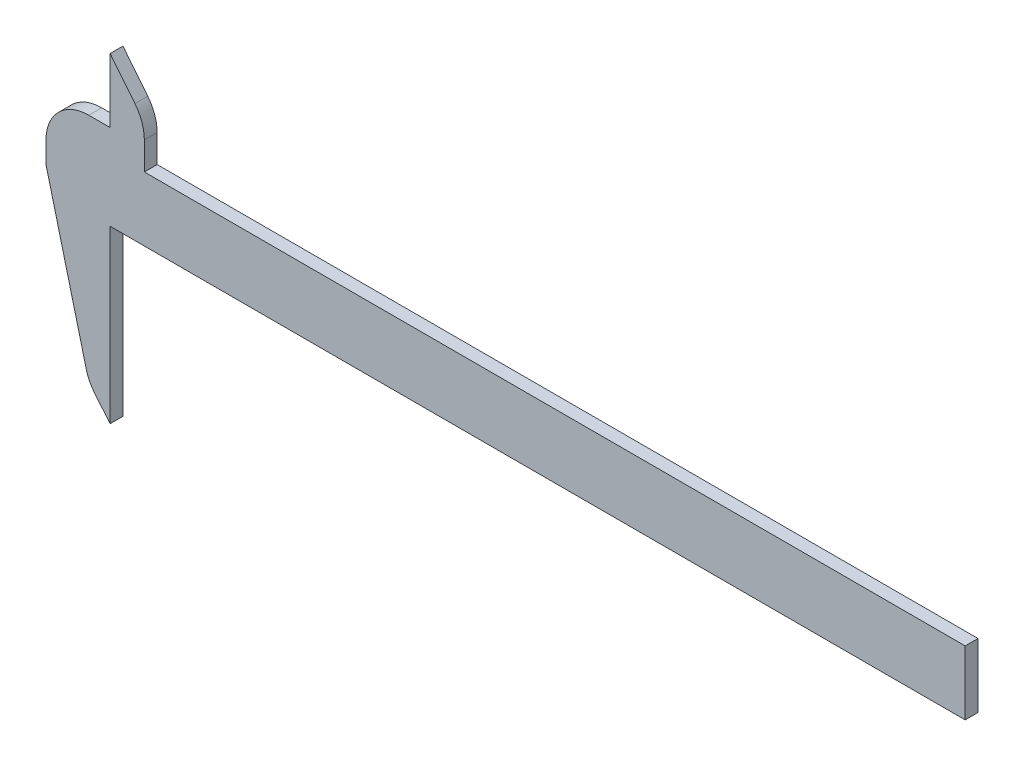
ISO-10303-21;
HEADER;
FILE_DESCRIPTION(('STEP AP214'),'2;1');
FILE_NAME('part.step','',(''),(''),'','','');
FILE_SCHEMA(('AUTOMOTIVE_DESIGN { 1 0 10303 214 1 1 1 1 }'));
ENDSEC;
DATA;
#1=APPLICATION_CONTEXT('core data for automotive mechanical design processes');
#2=APPLICATION_PROTOCOL_DEFINITION('international standard','automotive_design',2000,#1);
#3=PRODUCT_CONTEXT('',#1,'mechanical');
#4=PRODUCT('Part','Part','',(#3));
#5=PRODUCT_RELATED_PRODUCT_CATEGORY('part','',(#4));
#6=PRODUCT_DEFINITION_FORMATION('','',#4);
#7=PRODUCT_DEFINITION_CONTEXT('part definition',#1,'design');
#8=PRODUCT_DEFINITION('design','',#6,#7);
#9=PRODUCT_DEFINITION_SHAPE('','',#8);
#10=(LENGTH_UNIT() NAMED_UNIT(*) SI_UNIT(.MILLI.,.METRE.));
#11=(NAMED_UNIT(*) PLANE_ANGLE_UNIT() SI_UNIT($,.RADIAN.));
#12=(NAMED_UNIT(*) SI_UNIT($,.STERADIAN.) SOLID_ANGLE_UNIT());
#13=UNCERTAINTY_MEASURE_WITH_UNIT(LENGTH_MEASURE(1.E-05),#10,'distance_accuracy_value','');
#14=(GEOMETRIC_REPRESENTATION_CONTEXT(3) GLOBAL_UNCERTAINTY_ASSIGNED_CONTEXT((#13)) GLOBAL_UNIT_ASSIGNED_CONTEXT((#10,
#11,#12)) REPRESENTATION_CONTEXT('',''));
#15=CARTESIAN_POINT('',(0.,0.,0.));
#16=DIRECTION('',(0.,0.,1.));
#17=DIRECTION('',(1.,0.,0.));
#18=AXIS2_PLACEMENT_3D('',#15,#16,#17);
#19=CARTESIAN_POINT('',(0.,-40.,3.));
#20=DIRECTION('',(-1.,0.,0.));
#21=DIRECTION('',(0.,0.,1.));
#22=AXIS2_PLACEMENT_3D('',#19,#20,#21);
#23=PLANE('',#22);
#24=DIRECTION('',(0.,1.,0.));
#25=VECTOR('',#24,1.);
#26=CARTESIAN_POINT('',(0.,-40.,0.));
#27=LINE('',#26,#25);
#28=CARTESIAN_POINT('',(0.,-40.,0.));
#29=VERTEX_POINT('',#28);
#30=CARTESIAN_POINT('',(0.,0.,0.));
#31=VERTEX_POINT('',#30);
#32=EDGE_CURVE('E156',#29,#31,#27,.T.);
#33=ORIENTED_EDGE('',*,*,#32,.T.);
#34=DIRECTION('',(0.,0.,-1.));
#35=VECTOR('',#34,1.);
#36=CARTESIAN_POINT('',(0.,0.,3.));
#37=LINE('',#36,#35);
#38=CARTESIAN_POINT('',(0.,0.,3.));
#39=VERTEX_POINT('',#38);
#40=EDGE_CURVE('E137',#39,#31,#37,.T.);
#41=ORIENTED_EDGE('',*,*,#40,.F.);
#42=DIRECTION('',(0.,1.,0.));
#43=VECTOR('',#42,1.);
#44=CARTESIAN_POINT('',(0.,-40.,3.));
#45=LINE('',#44,#43);
#46=CARTESIAN_POINT('',(0.,-40.,3.));
#47=VERTEX_POINT('',#46);
#48=EDGE_CURVE('E144',#47,#39,#45,.T.);
#49=ORIENTED_EDGE('',*,*,#48,.F.);
#50=DIRECTION('',(0.,0.,-1.));
#51=VECTOR('',#50,1.);
#52=CARTESIAN_POINT('',(0.,-40.,3.));
#53=LINE('',#52,#51);
#54=EDGE_CURVE('E213',#47,#29,#53,.T.);
#55=ORIENTED_EDGE('',*,*,#54,.T.);
#56=EDGE_LOOP('',(#33,#41,#49,#55));
#57=FACE_BOUND('',#56,.T.);
#58=ADVANCED_FACE('F32',(#57),#23,.F.);
#59=CARTESIAN_POINT('',(0.,0.,3.));
#60=DIRECTION('',(0.,1.,0.));
#61=DIRECTION('',(0.,0.,1.));
#62=AXIS2_PLACEMENT_3D('',#59,#60,#61);
#63=PLANE('',#62);
#64=DIRECTION('',(1.,0.,0.));
#65=VECTOR('',#64,1.);
#66=CARTESIAN_POINT('',(0.,0.,0.));
#67=LINE('',#66,#65);
#68=CARTESIAN_POINT('',(200.,0.,0.));
#69=VERTEX_POINT('',#68);
#70=EDGE_CURVE('E236',#31,#69,#67,.T.);
#71=ORIENTED_EDGE('',*,*,#70,.T.);
#72=DIRECTION('',(0.,0.,-1.));
#73=VECTOR('',#72,1.);
#74=CARTESIAN_POINT('',(200.,0.,3.));
#75=LINE('',#74,#73);
#76=CARTESIAN_POINT('',(200.,0.,3.));
#77=VERTEX_POINT('',#76);
#78=EDGE_CURVE('E140',#77,#69,#75,.T.);
#79=ORIENTED_EDGE('',*,*,#78,.F.);
#80=DIRECTION('',(1.,0.,0.));
#81=VECTOR('',#80,1.);
#82=CARTESIAN_POINT('',(0.,0.,3.));
#83=LINE('',#82,#81);
#84=EDGE_CURVE('E133',#39,#77,#83,.T.);
#85=ORIENTED_EDGE('',*,*,#84,.F.);
#86=ORIENTED_EDGE('',*,*,#40,.T.);
#87=EDGE_LOOP('',(#71,#79,#85,#86));
#88=FACE_BOUND('',#87,.T.);
#89=ADVANCED_FACE('F135',(#88),#63,.F.);
#90=CARTESIAN_POINT('',(200.,0.,3.));
#91=DIRECTION('',(-1.,0.,0.));
#92=DIRECTION('',(0.,0.,1.));
#93=AXIS2_PLACEMENT_3D('',#90,#91,#92);
#94=PLANE('',#93);
#95=DIRECTION('',(0.,1.,0.));
#96=VECTOR('',#95,1.);
#97=CARTESIAN_POINT('',(200.,0.,0.));
#98=LINE('',#97,#96);
#99=CARTESIAN_POINT('',(200.,15.,0.));
#100=VERTEX_POINT('',#99);
#101=EDGE_CURVE('E235',#69,#100,#98,.T.);
#102=ORIENTED_EDGE('',*,*,#101,.T.);
#103=DIRECTION('',(0.,0.,-1.));
#104=VECTOR('',#103,1.);
#105=CARTESIAN_POINT('',(200.,15.,3.));
#106=LINE('',#105,#104);
#107=CARTESIAN_POINT('',(200.,15.,3.));
#108=VERTEX_POINT('',#107);
#109=EDGE_CURVE('E162',#108,#100,#106,.T.);
#110=ORIENTED_EDGE('',*,*,#109,.F.);
#111=DIRECTION('',(0.,1.,0.));
#112=VECTOR('',#111,1.);
#113=CARTESIAN_POINT('',(200.,0.,3.));
#114=LINE('',#113,#112);
#115=EDGE_CURVE('E143',#77,#108,#114,.T.);
#116=ORIENTED_EDGE('',*,*,#115,.F.);
#117=ORIENTED_EDGE('',*,*,#78,.T.);
#118=EDGE_LOOP('',(#102,#110,#116,#117));
#119=FACE_BOUND('',#118,.T.);
#120=ADVANCED_FACE('F256',(#119),#94,.F.);
#121=CARTESIAN_POINT('',(200.,15.,3.));
#122=DIRECTION('',(0.,-1.,0.));
#123=DIRECTION('',(1.,0.,0.));
#124=AXIS2_PLACEMENT_3D('',#121,#122,#123);
#125=PLANE('',#124);
#126=DIRECTION('',(-1.,0.,0.));
#127=VECTOR('',#126,1.);
#128=CARTESIAN_POINT('',(200.,15.,0.));
#129=LINE('',#128,#127);
#130=CARTESIAN_POINT('',(8.00000000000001,15.,0.));
#131=VERTEX_POINT('',#130);
#132=EDGE_CURVE('E201',#100,#131,#129,.T.);
#133=ORIENTED_EDGE('',*,*,#132,.T.);
#134=DIRECTION('',(0.,0.,-1.));
#135=VECTOR('',#134,1.);
#136=CARTESIAN_POINT('',(8.00000000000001,15.,3.));
#137=LINE('',#136,#135);
#138=CARTESIAN_POINT('',(8.00000000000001,15.,3.));
#139=VERTEX_POINT('',#138);
#140=EDGE_CURVE('E223',#139,#131,#137,.T.);
#141=ORIENTED_EDGE('',*,*,#140,.F.);
#142=DIRECTION('',(-1.,0.,0.));
#143=VECTOR('',#142,1.);
#144=CARTESIAN_POINT('',(200.,15.,3.));
#145=LINE('',#144,#143);
#146=EDGE_CURVE('E232',#108,#139,#145,.T.);
#147=ORIENTED_EDGE('',*,*,#146,.F.);
#148=ORIENTED_EDGE('',*,*,#109,.T.);
#149=EDGE_LOOP('',(#133,#141,#147,#148));
#150=FACE_BOUND('',#149,.T.);
#151=ADVANCED_FACE('F230',(#150),#125,.F.);
#152=CARTESIAN_POINT('',(8.00000000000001,15.,3.));
#153=DIRECTION('',(-1.,0.,0.));
#154=DIRECTION('',(0.,-1.,0.));
#155=AXIS2_PLACEMENT_3D('',#152,#153,#154);
#156=PLANE('',#155);
#157=DIRECTION('',(0.,1.,0.));
#158=VECTOR('',#157,1.);
#159=CARTESIAN_POINT('',(8.00000000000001,15.,0.));
#160=LINE('',#159,#158);
#161=CARTESIAN_POINT('',(8.,21.4921894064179,0.));
#162=VERTEX_POINT('',#161);
#163=EDGE_CURVE('E197',#131,#162,#160,.T.);
#164=ORIENTED_EDGE('',*,*,#163,.T.);
#165=DIRECTION('',(0.,0.,-1.));
#166=VECTOR('',#165,1.);
#167=CARTESIAN_POINT('',(8.,21.4921894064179,3.));
#168=LINE('',#167,#166);
#169=CARTESIAN_POINT('',(8.,21.4921894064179,3.));
#170=VERTEX_POINT('',#169);
#171=EDGE_CURVE('E40',#162,#170,#168,.F.);
#172=ORIENTED_EDGE('',*,*,#171,.T.);
#173=DIRECTION('',(0.,1.,0.));
#174=VECTOR('',#173,1.);
#175=CARTESIAN_POINT('',(8.00000000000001,15.,3.));
#176=LINE('',#175,#174);
#177=EDGE_CURVE('E253',#139,#170,#176,.T.);
#178=ORIENTED_EDGE('',*,*,#177,.F.);
#179=ORIENTED_EDGE('',*,*,#140,.T.);
#180=EDGE_LOOP('',(#164,#172,#178,#179));
#181=FACE_BOUND('',#180,.T.);
#182=ADVANCED_FACE('F263',(#181),#156,.F.);
#183=CARTESIAN_POINT('',(8.,25.,3.));
#184=DIRECTION('',(-0.78086880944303,-0.624695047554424,0.));
#185=DIRECTION('',(0.624695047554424,-0.78086880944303,0.));
#186=AXIS2_PLACEMENT_3D('',#183,#184,#185);
#187=PLANE('',#186);
#188=DIRECTION('',(-0.624695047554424,0.78086880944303,0.));
#189=VECTOR('',#188,1.);
#190=CARTESIAN_POINT('',(8.,25.,3.));
#191=LINE('',#190,#189);
#192=CARTESIAN_POINT('',(5.80868809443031,27.7391398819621,3.));
#193=VERTEX_POINT('',#192);
#194=CARTESIAN_POINT('',(0.,35.,3.));
#195=VERTEX_POINT('',#194);
#196=EDGE_CURVE('E190',#193,#195,#191,.T.);
#197=ORIENTED_EDGE('',*,*,#196,.F.);
#198=DIRECTION('',(0.,0.,-1.));
#199=VECTOR('',#198,1.);
#200=CARTESIAN_POINT('',(5.80868809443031,27.7391398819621,3.));
#201=LINE('',#200,#199);
#202=CARTESIAN_POINT('',(5.80868809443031,27.7391398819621,0.));
#203=VERTEX_POINT('',#202);
#204=EDGE_CURVE('E180',#193,#203,#201,.T.);
#205=ORIENTED_EDGE('',*,*,#204,.T.);
#206=DIRECTION('',(-0.624695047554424,0.78086880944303,0.));
#207=VECTOR('',#206,1.);
#208=CARTESIAN_POINT('',(8.,25.,0.));
#209=LINE('',#208,#207);
#210=CARTESIAN_POINT('',(0.,35.,0.));
#211=VERTEX_POINT('',#210);
#212=EDGE_CURVE('E188',#203,#211,#209,.T.);
#213=ORIENTED_EDGE('',*,*,#212,.T.);
#214=DIRECTION('',(0.,0.,-1.));
#215=VECTOR('',#214,1.);
#216=CARTESIAN_POINT('',(0.,35.,3.));
#217=LINE('',#216,#215);
#218=EDGE_CURVE('E221',#195,#211,#217,.T.);
#219=ORIENTED_EDGE('',*,*,#218,.F.);
#220=EDGE_LOOP('',(#197,#205,#213,#219));
#221=FACE_BOUND('',#220,.T.);
#222=ADVANCED_FACE('F186',(#221),#187,.F.);
#223=CARTESIAN_POINT('',(0.,35.,3.));
#224=DIRECTION('',(1.,0.,0.));
#225=DIRECTION('',(0.,1.,0.));
#226=AXIS2_PLACEMENT_3D('',#223,#224,#225);
#227=PLANE('',#226);
#228=DIRECTION('',(0.,-1.,0.));
#229=VECTOR('',#228,1.);
#230=CARTESIAN_POINT('',(0.,35.,0.));
#231=LINE('',#230,#229);
#232=CARTESIAN_POINT('',(0.,20.,0.));
#233=VERTEX_POINT('',#232);
#234=EDGE_CURVE('E196',#211,#233,#231,.T.);
#235=ORIENTED_EDGE('',*,*,#234,.T.);
#236=DIRECTION('',(0.,0.,-1.));
#237=VECTOR('',#236,1.);
#238=CARTESIAN_POINT('',(0.,20.,3.));
#239=LINE('',#238,#237);
#240=CARTESIAN_POINT('',(0.,20.,3.));
#241=VERTEX_POINT('',#240);
#242=EDGE_CURVE('E218',#241,#233,#239,.T.);
#243=ORIENTED_EDGE('',*,*,#242,.F.);
#244=DIRECTION('',(0.,-1.,0.));
#245=VECTOR('',#244,1.);
#246=CARTESIAN_POINT('',(0.,35.,3.));
#247=LINE('',#246,#245);
#248=EDGE_CURVE('E250',#195,#241,#247,.T.);
#249=ORIENTED_EDGE('',*,*,#248,.F.);
#250=ORIENTED_EDGE('',*,*,#218,.T.);
#251=EDGE_LOOP('',(#235,#243,#249,#250));
#252=FACE_BOUND('',#251,.T.);
#253=ADVANCED_FACE('F304',(#252),#227,.F.);
#254=CARTESIAN_POINT('',(0.,20.,3.));
#255=DIRECTION('',(0.,-1.,0.));
#256=DIRECTION('',(1.,0.,0.));
#257=AXIS2_PLACEMENT_3D('',#254,#255,#256);
#258=PLANE('',#257);
#259=DIRECTION('',(-1.,0.,0.));
#260=VECTOR('',#259,1.);
#261=CARTESIAN_POINT('',(0.,20.,0.));
#262=LINE('',#261,#260);
#263=CARTESIAN_POINT('',(-5.,20.,0.));
#264=VERTEX_POINT('',#263);
#265=EDGE_CURVE('E199',#233,#264,#262,.T.);
#266=ORIENTED_EDGE('',*,*,#265,.T.);
#267=DIRECTION('',(0.,0.,-1.));
#268=VECTOR('',#267,1.);
#269=CARTESIAN_POINT('',(-5.,20.,3.));
#270=LINE('',#269,#268);
#271=CARTESIAN_POINT('',(-5.,20.,3.));
#272=VERTEX_POINT('',#271);
#273=EDGE_CURVE('E167',#264,#272,#270,.F.);
#274=ORIENTED_EDGE('',*,*,#273,.T.);
#275=DIRECTION('',(-1.,0.,0.));
#276=VECTOR('',#275,1.);
#277=CARTESIAN_POINT('',(0.,20.,3.));
#278=LINE('',#277,#276);
#279=EDGE_CURVE('E247',#241,#272,#278,.T.);
#280=ORIENTED_EDGE('',*,*,#279,.F.);
#281=ORIENTED_EDGE('',*,*,#242,.T.);
#282=EDGE_LOOP('',(#266,#274,#280,#281));
#283=FACE_BOUND('',#282,.T.);
#284=ADVANCED_FACE('F298',(#283),#258,.F.);
#285=CARTESIAN_POINT('',(-15.,20.,3.));
#286=DIRECTION('',(1.,0.,0.));
#287=DIRECTION('',(0.,0.,-1.));
#288=AXIS2_PLACEMENT_3D('',#285,#286,#287);
#289=PLANE('',#288);
#290=DIRECTION('',(0.,-1.,0.));
#291=VECTOR('',#290,1.);
#292=CARTESIAN_POINT('',(-15.,20.,3.));
#293=LINE('',#292,#291);
#294=CARTESIAN_POINT('',(-15.,9.99999999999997,3.));
#295=VERTEX_POINT('',#294);
#296=CARTESIAN_POINT('',(-15.,4.99999999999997,3.));
#297=VERTEX_POINT('',#296);
#298=EDGE_CURVE('E245',#295,#297,#293,.T.);
#299=ORIENTED_EDGE('',*,*,#298,.F.);
#300=DIRECTION('',(0.,0.,-1.));
#301=VECTOR('',#300,1.);
#302=CARTESIAN_POINT('',(-15.,9.99999999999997,3.));
#303=LINE('',#302,#301);
#304=CARTESIAN_POINT('',(-15.,9.99999999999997,0.));
#305=VERTEX_POINT('',#304);
#306=EDGE_CURVE('E157',#295,#305,#303,.T.);
#307=ORIENTED_EDGE('',*,*,#306,.T.);
#308=DIRECTION('',(0.,-1.,0.));
#309=VECTOR('',#308,1.);
#310=CARTESIAN_POINT('',(-15.,20.,0.));
#311=LINE('',#310,#309);
#312=CARTESIAN_POINT('',(-15.,4.99999999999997,0.));
#313=VERTEX_POINT('',#312);
#314=EDGE_CURVE('E207',#305,#313,#311,.T.);
#315=ORIENTED_EDGE('',*,*,#314,.T.);
#316=DIRECTION('',(0.,0.,-1.));
#317=VECTOR('',#316,1.);
#318=CARTESIAN_POINT('',(-15.,4.99999999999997,3.));
#319=LINE('',#318,#317);
#320=EDGE_CURVE('E215',#297,#313,#319,.T.);
#321=ORIENTED_EDGE('',*,*,#320,.F.);
#322=EDGE_LOOP('',(#299,#307,#315,#321));
#323=FACE_BOUND('',#322,.T.);
#324=ADVANCED_FACE('F294',(#323),#289,.F.);
#325=CARTESIAN_POINT('',(-15.,4.99999999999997,3.));
#326=DIRECTION('',(0.968663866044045,0.248375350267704,0.));
#327=DIRECTION('',(-0.248375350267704,0.968663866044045,0.));
#328=AXIS2_PLACEMENT_3D('',#325,#326,#327);
#329=PLANE('',#328);
#330=DIRECTION('',(0.248375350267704,-0.968663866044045,0.));
#331=VECTOR('',#330,1.);
#332=CARTESIAN_POINT('',(-15.,4.99999999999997,0.));
#333=LINE('',#332,#331);
#334=CARTESIAN_POINT('',(-5.56028868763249,-31.8148741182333,0.));
#335=VERTEX_POINT('',#334);
#336=EDGE_CURVE('E209',#313,#335,#333,.T.);
#337=ORIENTED_EDGE('',*,*,#336,.T.);
#338=DIRECTION('',(0.,0.,-1.));
#339=VECTOR('',#338,1.);
#340=CARTESIAN_POINT('',(-5.56028868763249,-31.8148741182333,3.));
#341=LINE('',#340,#339);
#342=CARTESIAN_POINT('',(-5.56028868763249,-31.8148741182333,3.));
#343=VERTEX_POINT('',#342);
#344=EDGE_CURVE('E176',#335,#343,#341,.F.);
#345=ORIENTED_EDGE('',*,*,#344,.T.);
#346=DIRECTION('',(0.248375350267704,-0.968663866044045,0.));
#347=VECTOR('',#346,1.);
#348=CARTESIAN_POINT('',(-15.,4.99999999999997,3.));
#349=LINE('',#348,#347);
#350=EDGE_CURVE('E242',#297,#343,#349,.T.);
#351=ORIENTED_EDGE('',*,*,#350,.F.);
#352=ORIENTED_EDGE('',*,*,#320,.T.);
#353=EDGE_LOOP('',(#337,#345,#351,#352));
#354=FACE_BOUND('',#353,.T.);
#355=ADVANCED_FACE('F290',(#354),#329,.F.);
#356=CARTESIAN_POINT('',(-5.,-34.,3.));
#357=DIRECTION('',(0.768221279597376,0.64018439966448,0.));
#358=DIRECTION('',(-0.64018439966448,0.768221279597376,0.));
#359=AXIS2_PLACEMENT_3D('',#356,#357,#358);
#360=PLANE('',#359);
#361=DIRECTION('',(0.64018439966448,-0.768221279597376,0.));
#362=VECTOR('',#361,1.);
#363=CARTESIAN_POINT('',(-5.,-34.,3.));
#364=LINE('',#363,#362);
#365=CARTESIAN_POINT('',(-3.5558628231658,-35.732964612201,3.));
#366=VERTEX_POINT('',#365);
#367=EDGE_CURVE('E149',#366,#47,#364,.T.);
#368=ORIENTED_EDGE('',*,*,#367,.F.);
#369=DIRECTION('',(0.,0.,-1.));
#370=VECTOR('',#369,1.);
#371=CARTESIAN_POINT('',(-3.5558628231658,-35.732964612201,3.));
#372=LINE('',#371,#370);
#373=CARTESIAN_POINT('',(-3.5558628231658,-35.732964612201,0.));
#374=VERTEX_POINT('',#373);
#375=EDGE_CURVE('E171',#366,#374,#372,.T.);
#376=ORIENTED_EDGE('',*,*,#375,.T.);
#377=DIRECTION('',(0.64018439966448,-0.768221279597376,0.));
#378=VECTOR('',#377,1.);
#379=CARTESIAN_POINT('',(-5.,-34.,0.));
#380=LINE('',#379,#378);
#381=EDGE_CURVE('E153',#374,#29,#380,.T.);
#382=ORIENTED_EDGE('',*,*,#381,.T.);
#383=ORIENTED_EDGE('',*,*,#54,.F.);
#384=EDGE_LOOP('',(#368,#376,#382,#383));
#385=FACE_BOUND('',#384,.T.);
#386=ADVANCED_FACE('F285',(#385),#360,.F.);
#387=CARTESIAN_POINT('',(0.,0.,3.));
#388=DIRECTION('',(0.,0.,-1.));
#389=DIRECTION('',(-1.,0.,0.));
#390=AXIS2_PLACEMENT_3D('',#387,#388,#389);
#391=PLANE('',#390);
#392=ORIENTED_EDGE('',*,*,#177,.T.);
#393=CARTESIAN_POINT('',(-2.,21.4921894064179,3.));
#394=DIRECTION('',(0.,0.,-1.));
#395=DIRECTION('',(-1.,0.,0.));
#396=AXIS2_PLACEMENT_3D('',#393,#394,#395);
#397=CIRCLE('',#396,10.);
#398=EDGE_CURVE('E11',#170,#193,#397,.F.);
#399=ORIENTED_EDGE('',*,*,#398,.T.);
#400=ORIENTED_EDGE('',*,*,#196,.T.);
#401=ORIENTED_EDGE('',*,*,#248,.T.);
#402=ORIENTED_EDGE('',*,*,#279,.T.);
#403=CARTESIAN_POINT('',(-5.,9.99999999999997,3.));
#404=DIRECTION('',(0.,0.,-1.));
#405=DIRECTION('',(-1.,0.,0.));
#406=AXIS2_PLACEMENT_3D('',#403,#404,#405);
#407=CIRCLE('',#406,10.);
#408=EDGE_CURVE('E169',#272,#295,#407,.F.);
#409=ORIENTED_EDGE('',*,*,#408,.T.);
#410=ORIENTED_EDGE('',*,*,#298,.T.);
#411=ORIENTED_EDGE('',*,*,#350,.T.);
#412=CARTESIAN_POINT('',(4.12634997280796,-29.3311206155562,3.));
#413=DIRECTION('',(0.,0.,-1.));
#414=DIRECTION('',(-1.,0.,0.));
#415=AXIS2_PLACEMENT_3D('',#412,#413,#414);
#416=CIRCLE('',#415,10.);
#417=EDGE_CURVE('E178',#343,#366,#416,.F.);
#418=ORIENTED_EDGE('',*,*,#417,.T.);
#419=ORIENTED_EDGE('',*,*,#367,.T.);
#420=ORIENTED_EDGE('',*,*,#48,.T.);
#421=ORIENTED_EDGE('',*,*,#84,.T.);
#422=ORIENTED_EDGE('',*,*,#115,.T.);
#423=ORIENTED_EDGE('',*,*,#146,.T.);
#424=EDGE_LOOP('',(#392,#399,#400,#401,#402,#409,#410,#411,#418,#419,#420,#421,#422,#423));
#425=FACE_BOUND('',#424,.T.);
#426=ADVANCED_FACE('F147',(#425),#391,.F.);
#427=CARTESIAN_POINT('',(0.,0.,0.));
#428=DIRECTION('',(0.,0.,-1.));
#429=DIRECTION('',(-1.,0.,0.));
#430=AXIS2_PLACEMENT_3D('',#427,#428,#429);
#431=PLANE('',#430);
#432=ORIENTED_EDGE('',*,*,#212,.F.);
#433=CARTESIAN_POINT('',(-2.,21.4921894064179,0.));
#434=DIRECTION('',(0.,0.,-1.));
#435=DIRECTION('',(-1.,0.,0.));
#436=AXIS2_PLACEMENT_3D('',#433,#434,#435);
#437=CIRCLE('',#436,10.);
#438=EDGE_CURVE('E54',#203,#162,#437,.T.);
#439=ORIENTED_EDGE('',*,*,#438,.T.);
#440=ORIENTED_EDGE('',*,*,#163,.F.);
#441=ORIENTED_EDGE('',*,*,#132,.F.);
#442=ORIENTED_EDGE('',*,*,#101,.F.);
#443=ORIENTED_EDGE('',*,*,#70,.F.);
#444=ORIENTED_EDGE('',*,*,#32,.F.);
#445=ORIENTED_EDGE('',*,*,#381,.F.);
#446=CARTESIAN_POINT('',(4.12634997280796,-29.3311206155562,0.));
#447=DIRECTION('',(0.,0.,-1.));
#448=DIRECTION('',(-1.,0.,0.));
#449=AXIS2_PLACEMENT_3D('',#446,#447,#448);
#450=CIRCLE('',#449,10.);
#451=EDGE_CURVE('E174',#374,#335,#450,.T.);
#452=ORIENTED_EDGE('',*,*,#451,.T.);
#453=ORIENTED_EDGE('',*,*,#336,.F.);
#454=ORIENTED_EDGE('',*,*,#314,.F.);
#455=CARTESIAN_POINT('',(-5.,9.99999999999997,0.));
#456=DIRECTION('',(0.,0.,-1.));
#457=DIRECTION('',(-1.,0.,0.));
#458=AXIS2_PLACEMENT_3D('',#455,#456,#457);
#459=CIRCLE('',#458,10.);
#460=EDGE_CURVE('E160',#305,#264,#459,.T.);
#461=ORIENTED_EDGE('',*,*,#460,.T.);
#462=ORIENTED_EDGE('',*,*,#265,.F.);
#463=ORIENTED_EDGE('',*,*,#234,.F.);
#464=EDGE_LOOP('',(#432,#439,#440,#441,#442,#443,#444,#445,#452,#453,#454,#461,#462,#463));
#465=FACE_BOUND('',#464,.T.);
#466=ADVANCED_FACE('F194',(#465),#431,.T.);
#467=CARTESIAN_POINT('',(-5.,9.99999999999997,3.));
#468=DIRECTION('',(0.,0.,-1.));
#469=DIRECTION('',(-1.,0.,0.));
#470=AXIS2_PLACEMENT_3D('',#467,#468,#469);
#471=CYLINDRICAL_SURFACE('',#470,10.);
#472=ORIENTED_EDGE('',*,*,#408,.F.);
#473=ORIENTED_EDGE('',*,*,#273,.F.);
#474=ORIENTED_EDGE('',*,*,#460,.F.);
#475=ORIENTED_EDGE('',*,*,#306,.F.);
#476=EDGE_LOOP('',(#472,#473,#474,#475));
#477=FACE_BOUND('',#476,.T.);
#478=ADVANCED_FACE('F271',(#477),#471,.T.);
#479=CARTESIAN_POINT('',(4.12634997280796,-29.3311206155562,3.));
#480=DIRECTION('',(0.,0.,-1.));
#481=DIRECTION('',(-1.,0.,0.));
#482=AXIS2_PLACEMENT_3D('',#479,#480,#481);
#483=CYLINDRICAL_SURFACE('',#482,10.);
#484=ORIENTED_EDGE('',*,*,#417,.F.);
#485=ORIENTED_EDGE('',*,*,#344,.F.);
#486=ORIENTED_EDGE('',*,*,#451,.F.);
#487=ORIENTED_EDGE('',*,*,#375,.F.);
#488=EDGE_LOOP('',(#484,#485,#486,#487));
#489=FACE_BOUND('',#488,.T.);
#490=ADVANCED_FACE('F273',(#489),#483,.T.);
#491=CARTESIAN_POINT('',(-2.,21.4921894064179,3.));
#492=DIRECTION('',(0.,0.,-1.));
#493=DIRECTION('',(-1.,0.,0.));
#494=AXIS2_PLACEMENT_3D('',#491,#492,#493);
#495=CYLINDRICAL_SURFACE('',#494,10.);
#496=ORIENTED_EDGE('',*,*,#398,.F.);
#497=ORIENTED_EDGE('',*,*,#171,.F.);
#498=ORIENTED_EDGE('',*,*,#438,.F.);
#499=ORIENTED_EDGE('',*,*,#204,.F.);
#500=EDGE_LOOP('',(#496,#497,#498,#499));
#501=FACE_BOUND('',#500,.T.);
#502=ADVANCED_FACE('F34',(#501),#495,.T.);
#503=CLOSED_SHELL('',(#58,#89,#120,#151,#182,#222,#253,#284,#324,#355,#386,#426,#466,#478,#490,#502));
#504=MANIFOLD_SOLID_BREP('B2',#503);
#505=ADVANCED_BREP_SHAPE_REPRESENTATION('',(#18,#504),#14);
#506=SHAPE_DEFINITION_REPRESENTATION(#9,#505);
ENDSEC;
END-ISO-10303-21;
